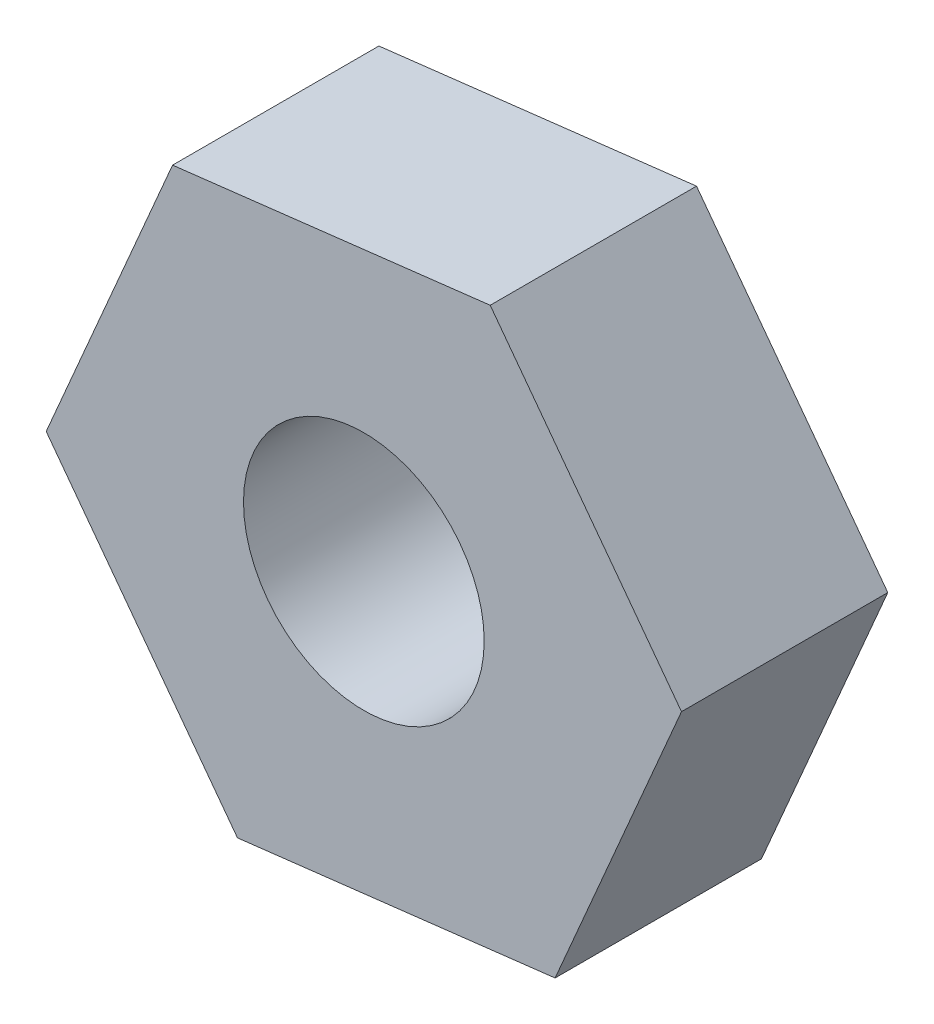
from build123d import *

# Parameters (mm, degrees)
BOSS_EXTRUDE1_DEPTH              = 6
TAP_DRILL_SLOT_FOR_M8X1_0_TAP1_D = 7


with BuildPart() as part:
    # Sketch1 → Boss-Extrude1 (new body)
    with BuildSketch(Plane.XY):
        Polygon((-5.562427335, 7.455197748), (-9.237604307, -1.089604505), (-3.675176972, -8.544802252), (5.562427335, -7.455197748), (9.237604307, 1.089604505), (3.675176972, 8.544802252), align=None)
    extrude(amount=BOSS_EXTRUDE1_DEPTH)

    # Tap Drill Slot for M8x1.0 Tap1 (through all)
    with Locations(Plane.XY.offset(6)):
        with Locations((0, 0)):
            Hole(TAP_DRILL_SLOT_FOR_M8X1_0_TAP1_D / 2)


solid = part.part
